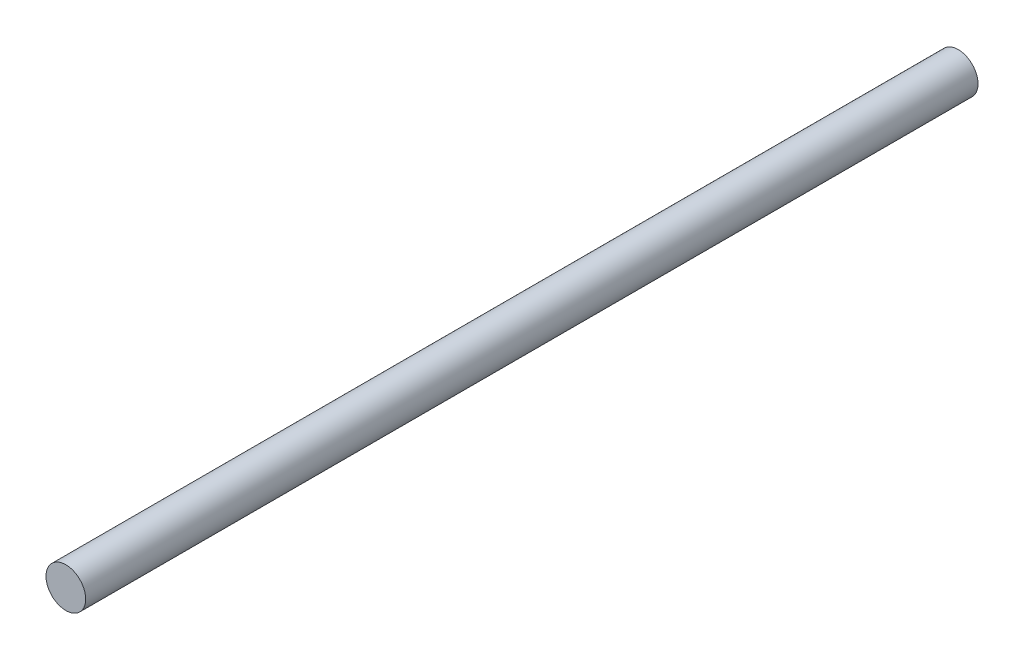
from build123d import *

# Parameters (mm, degrees)
SKETCH1_R           = 1
BOSS_EXTRUDE1_DEPTH = 22.5


with BuildPart() as part:
    # Sketch1 → Boss-Extrude1 (new, symmetric)
    with BuildSketch(Plane.XY):
        with Locations(Location((0, 0, 0), (0, 0, 180))):
            Circle(SKETCH1_R)
    extrude(amount=BOSS_EXTRUDE1_DEPTH, both=True)


solid = part.part
